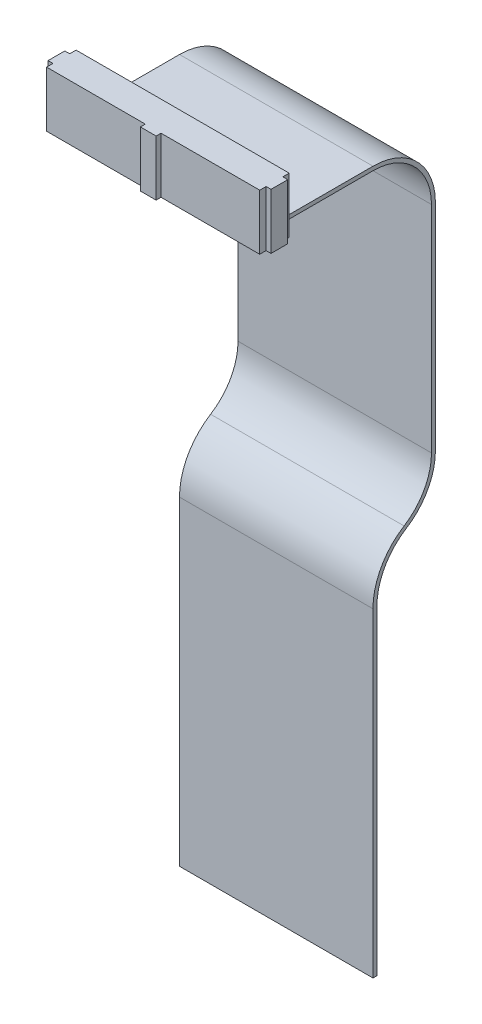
ISO-10303-21;
HEADER;
FILE_DESCRIPTION(('STEP AP214'),'2;1');
FILE_NAME('part.step','',(''),(''),'','','');
FILE_SCHEMA(('AUTOMOTIVE_DESIGN { 1 0 10303 214 1 1 1 1 }'));
ENDSEC;
DATA;
#1=APPLICATION_CONTEXT('core data for automotive mechanical design processes');
#2=APPLICATION_PROTOCOL_DEFINITION('international standard','automotive_design',2000,#1);
#3=PRODUCT_CONTEXT('',#1,'mechanical');
#4=PRODUCT('Part','Part','',(#3));
#5=PRODUCT_RELATED_PRODUCT_CATEGORY('part','',(#4));
#6=PRODUCT_DEFINITION_FORMATION('','',#4);
#7=PRODUCT_DEFINITION_CONTEXT('part definition',#1,'design');
#8=PRODUCT_DEFINITION('design','',#6,#7);
#9=PRODUCT_DEFINITION_SHAPE('','',#8);
#10=(LENGTH_UNIT() NAMED_UNIT(*) SI_UNIT(.MILLI.,.METRE.));
#11=(NAMED_UNIT(*) PLANE_ANGLE_UNIT() SI_UNIT($,.RADIAN.));
#12=(NAMED_UNIT(*) SI_UNIT($,.STERADIAN.) SOLID_ANGLE_UNIT());
#13=UNCERTAINTY_MEASURE_WITH_UNIT(LENGTH_MEASURE(1.E-05),#10,'distance_accuracy_value','');
#14=(GEOMETRIC_REPRESENTATION_CONTEXT(3) GLOBAL_UNCERTAINTY_ASSIGNED_CONTEXT((#13)) GLOBAL_UNIT_ASSIGNED_CONTEXT((#10,
#11,#12)) REPRESENTATION_CONTEXT('',''));
#15=CARTESIAN_POINT('',(0.,0.,0.));
#16=DIRECTION('',(0.,0.,1.));
#17=DIRECTION('',(1.,0.,0.));
#18=AXIS2_PLACEMENT_3D('',#15,#16,#17);
#19=CARTESIAN_POINT('',(-21.685,11.3,-6.00000000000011));
#20=DIRECTION('',(1.,0.,0.));
#21=DIRECTION('',(0.,0.,-1.00000000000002));
#22=AXIS2_PLACEMENT_3D('',#19,#20,#21);
#23=PLANE('',#22);
#24=DIRECTION('',(0.,0.,1.00000000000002));
#25=VECTOR('',#24,1.);
#26=CARTESIAN_POINT('',(-21.6850000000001,-2.22044604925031E-13,-6.00000000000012));
#27=LINE('',#26,#25);
#28=CARTESIAN_POINT('',(-21.6850000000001,-2.22044604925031E-13,-6.00000000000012));
#29=VERTEX_POINT('',#28);
#30=CARTESIAN_POINT('',(-21.6850000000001,-2.22044604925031E-13,-4.70000000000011));
#31=VERTEX_POINT('',#30);
#32=EDGE_CURVE('E356',#29,#31,#27,.T.);
#33=ORIENTED_EDGE('',*,*,#32,.T.);
#34=DIRECTION('',(0.,-1.,0.));
#35=VECTOR('',#34,1.);
#36=CARTESIAN_POINT('',(-21.685,11.3,-4.70000000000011));
#37=LINE('',#36,#35);
#38=CARTESIAN_POINT('',(-21.685,11.3,-4.70000000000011));
#39=VERTEX_POINT('',#38);
#40=EDGE_CURVE('E11',#39,#31,#37,.T.);
#41=ORIENTED_EDGE('',*,*,#40,.F.);
#42=DIRECTION('',(0.,0.,1.00000000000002));
#43=VECTOR('',#42,1.);
#44=CARTESIAN_POINT('',(-21.685,11.3,-6.00000000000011));
#45=LINE('',#44,#43);
#46=CARTESIAN_POINT('',(-21.685,11.3,-6.00000000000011));
#47=VERTEX_POINT('',#46);
#48=EDGE_CURVE('E389',#47,#39,#45,.T.);
#49=ORIENTED_EDGE('',*,*,#48,.F.);
#50=DIRECTION('',(0.,-1.,0.));
#51=VECTOR('',#50,1.);
#52=CARTESIAN_POINT('',(-21.685,11.3,-6.00000000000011));
#53=LINE('',#52,#51);
#54=EDGE_CURVE('E422',#47,#29,#53,.T.);
#55=ORIENTED_EDGE('',*,*,#54,.T.);
#56=EDGE_LOOP('',(#33,#41,#49,#55));
#57=FACE_BOUND('',#56,.T.);
#58=ADVANCED_FACE('F34',(#57),#23,.F.);
#59=CARTESIAN_POINT('',(-22.685,11.3,-4.70000000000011));
#60=DIRECTION('',(0.,0.,1.00000000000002));
#61=DIRECTION('',(1.,0.,0.));
#62=AXIS2_PLACEMENT_3D('',#59,#60,#61);
#63=PLANE('',#62);
#64=DIRECTION('',(-1.,0.,0.));
#65=VECTOR('',#64,1.);
#66=CARTESIAN_POINT('',(-22.6850000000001,-2.22044604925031E-13,-4.70000000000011));
#67=LINE('',#66,#65);
#68=CARTESIAN_POINT('',(-22.6850000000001,-2.22044604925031E-13,-4.70000000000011));
#69=VERTEX_POINT('',#68);
#70=EDGE_CURVE('E359',#31,#69,#67,.T.);
#71=ORIENTED_EDGE('',*,*,#70,.T.);
#72=DIRECTION('',(0.,-1.,0.));
#73=VECTOR('',#72,1.);
#74=CARTESIAN_POINT('',(-22.685,11.3,-4.70000000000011));
#75=LINE('',#74,#73);
#76=CARTESIAN_POINT('',(-22.685,11.3,-4.70000000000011));
#77=VERTEX_POINT('',#76);
#78=EDGE_CURVE('E41',#77,#69,#75,.T.);
#79=ORIENTED_EDGE('',*,*,#78,.F.);
#80=DIRECTION('',(-1.,0.,0.));
#81=VECTOR('',#80,1.);
#82=CARTESIAN_POINT('',(-22.685,11.3,-4.70000000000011));
#83=LINE('',#82,#81);
#84=EDGE_CURVE('E392',#39,#77,#83,.T.);
#85=ORIENTED_EDGE('',*,*,#84,.F.);
#86=ORIENTED_EDGE('',*,*,#40,.T.);
#87=EDGE_LOOP('',(#71,#79,#85,#86));
#88=FACE_BOUND('',#87,.T.);
#89=ADVANCED_FACE('F491',(#88),#63,.F.);
#90=CARTESIAN_POINT('',(-22.685,11.3,-4.70000000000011));
#91=DIRECTION('',(1.,0.,0.));
#92=DIRECTION('',(0.,0.,-1.00000000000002));
#93=AXIS2_PLACEMENT_3D('',#90,#91,#92);
#94=PLANE('',#93);
#95=DIRECTION('',(0.,0.,1.00000000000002));
#96=VECTOR('',#95,1.);
#97=CARTESIAN_POINT('',(-22.6850000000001,-2.22044604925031E-13,-4.70000000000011));
#98=LINE('',#97,#96);
#99=CARTESIAN_POINT('',(-22.6850000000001,-2.22044604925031E-13,-1.30000000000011));
#100=VERTEX_POINT('',#99);
#101=EDGE_CURVE('E361',#69,#100,#98,.T.);
#102=ORIENTED_EDGE('',*,*,#101,.T.);
#103=DIRECTION('',(0.,-1.,0.));
#104=VECTOR('',#103,1.);
#105=CARTESIAN_POINT('',(-22.685,11.3,-1.30000000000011));
#106=LINE('',#105,#104);
#107=CARTESIAN_POINT('',(-22.685,11.3,-1.30000000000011));
#108=VERTEX_POINT('',#107);
#109=EDGE_CURVE('E461',#108,#100,#106,.T.);
#110=ORIENTED_EDGE('',*,*,#109,.F.);
#111=DIRECTION('',(0.,0.,1.00000000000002));
#112=VECTOR('',#111,1.);
#113=CARTESIAN_POINT('',(-22.685,11.3,-4.70000000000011));
#114=LINE('',#113,#112);
#115=EDGE_CURVE('E394',#77,#108,#114,.T.);
#116=ORIENTED_EDGE('',*,*,#115,.F.);
#117=ORIENTED_EDGE('',*,*,#78,.T.);
#118=EDGE_LOOP('',(#102,#110,#116,#117));
#119=FACE_BOUND('',#118,.T.);
#120=ADVANCED_FACE('F468',(#119),#94,.F.);
#121=CARTESIAN_POINT('',(-22.685,11.3,-1.30000000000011));
#122=DIRECTION('',(0.,0.,-1.00000000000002));
#123=DIRECTION('',(-1.,0.,0.));
#124=AXIS2_PLACEMENT_3D('',#121,#122,#123);
#125=PLANE('',#124);
#126=DIRECTION('',(1.,0.,0.));
#127=VECTOR('',#126,1.);
#128=CARTESIAN_POINT('',(-22.6850000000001,-2.22044604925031E-13,-1.30000000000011));
#129=LINE('',#128,#127);
#130=CARTESIAN_POINT('',(-21.6850000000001,-2.22044604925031E-13,-1.30000000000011));
#131=VERTEX_POINT('',#130);
#132=EDGE_CURVE('E363',#100,#131,#129,.T.);
#133=ORIENTED_EDGE('',*,*,#132,.T.);
#134=DIRECTION('',(0.,-1.,0.));
#135=VECTOR('',#134,1.);
#136=CARTESIAN_POINT('',(-21.685,11.3,-1.30000000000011));
#137=LINE('',#136,#135);
#138=CARTESIAN_POINT('',(-21.685,11.3,-1.30000000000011));
#139=VERTEX_POINT('',#138);
#140=EDGE_CURVE('E458',#139,#131,#137,.T.);
#141=ORIENTED_EDGE('',*,*,#140,.F.);
#142=DIRECTION('',(1.,0.,0.));
#143=VECTOR('',#142,1.);
#144=CARTESIAN_POINT('',(-22.685,11.3,-1.30000000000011));
#145=LINE('',#144,#143);
#146=EDGE_CURVE('E396',#108,#139,#145,.T.);
#147=ORIENTED_EDGE('',*,*,#146,.F.);
#148=ORIENTED_EDGE('',*,*,#109,.T.);
#149=EDGE_LOOP('',(#133,#141,#147,#148));
#150=FACE_BOUND('',#149,.T.);
#151=ADVANCED_FACE('F479',(#150),#125,.F.);
#152=CARTESIAN_POINT('',(-21.685,11.3,-1.30000000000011));
#153=DIRECTION('',(1.,0.,0.));
#154=DIRECTION('',(0.,0.,-1.00000000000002));
#155=AXIS2_PLACEMENT_3D('',#152,#153,#154);
#156=PLANE('',#155);
#157=DIRECTION('',(0.,0.,1.00000000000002));
#158=VECTOR('',#157,1.);
#159=CARTESIAN_POINT('',(-21.6850000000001,-2.22044604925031E-13,-1.30000000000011));
#160=LINE('',#159,#158);
#161=CARTESIAN_POINT('',(-21.6850000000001,-2.22044604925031E-13,-1.11022302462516E-13));
#162=VERTEX_POINT('',#161);
#163=EDGE_CURVE('E365',#131,#162,#160,.T.);
#164=ORIENTED_EDGE('',*,*,#163,.T.);
#165=DIRECTION('',(0.,-1.,0.));
#166=VECTOR('',#165,1.);
#167=CARTESIAN_POINT('',(-21.685,11.3,-1.11022302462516E-13));
#168=LINE('',#167,#166);
#169=CARTESIAN_POINT('',(-21.685,11.3,-1.11022302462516E-13));
#170=VERTEX_POINT('',#169);
#171=EDGE_CURVE('E455',#170,#162,#168,.T.);
#172=ORIENTED_EDGE('',*,*,#171,.F.);
#173=DIRECTION('',(0.,0.,1.00000000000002));
#174=VECTOR('',#173,1.);
#175=CARTESIAN_POINT('',(-21.685,11.3,-1.30000000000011));
#176=LINE('',#175,#174);
#177=EDGE_CURVE('E398',#139,#170,#176,.T.);
#178=ORIENTED_EDGE('',*,*,#177,.F.);
#179=ORIENTED_EDGE('',*,*,#140,.T.);
#180=EDGE_LOOP('',(#164,#172,#178,#179));
#181=FACE_BOUND('',#180,.T.);
#182=ADVANCED_FACE('F483',(#181),#156,.F.);
#183=CARTESIAN_POINT('',(-21.685,11.3,-1.11022302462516E-13));
#184=DIRECTION('',(0.,0.,-1.00000000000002));
#185=DIRECTION('',(-1.,0.,0.));
#186=AXIS2_PLACEMENT_3D('',#183,#184,#185);
#187=PLANE('',#186);
#188=DIRECTION('',(1.,0.,0.));
#189=VECTOR('',#188,1.);
#190=CARTESIAN_POINT('',(-21.6850000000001,-2.22044604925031E-13,-1.11022302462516E-13));
#191=LINE('',#190,#189);
#192=CARTESIAN_POINT('',(-1.6,0.,0.));
#193=VERTEX_POINT('',#192);
#194=EDGE_CURVE('E367',#162,#193,#191,.T.);
#195=ORIENTED_EDGE('',*,*,#194,.T.);
#196=DIRECTION('',(0.,-1.,0.));
#197=VECTOR('',#196,1.);
#198=CARTESIAN_POINT('',(-1.59999999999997,11.3000000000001,0.));
#199=LINE('',#198,#197);
#200=CARTESIAN_POINT('',(-1.59999999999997,11.3000000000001,0.));
#201=VERTEX_POINT('',#200);
#202=EDGE_CURVE('E452',#201,#193,#199,.T.);
#203=ORIENTED_EDGE('',*,*,#202,.F.);
#204=DIRECTION('',(1.,0.,0.));
#205=VECTOR('',#204,1.);
#206=CARTESIAN_POINT('',(-21.685,11.3,-1.11022302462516E-13));
#207=LINE('',#206,#205);
#208=EDGE_CURVE('E400',#170,#201,#207,.T.);
#209=ORIENTED_EDGE('',*,*,#208,.F.);
#210=ORIENTED_EDGE('',*,*,#171,.T.);
#211=EDGE_LOOP('',(#195,#203,#209,#210));
#212=FACE_BOUND('',#211,.T.);
#213=ADVANCED_FACE('F544',(#212),#187,.F.);
#214=CARTESIAN_POINT('',(-1.59999999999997,11.3000000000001,0.));
#215=DIRECTION('',(1.,0.,0.));
#216=DIRECTION('',(0.,0.,-1.00000000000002));
#217=AXIS2_PLACEMENT_3D('',#214,#215,#216);
#218=PLANE('',#217);
#219=DIRECTION('',(0.,0.,1.00000000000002));
#220=VECTOR('',#219,1.);
#221=CARTESIAN_POINT('',(-1.6,0.,0.));
#222=LINE('',#221,#220);
#223=CARTESIAN_POINT('',(-1.59999999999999,0.,1.));
#224=VERTEX_POINT('',#223);
#225=EDGE_CURVE('E369',#193,#224,#222,.T.);
#226=ORIENTED_EDGE('',*,*,#225,.T.);
#227=DIRECTION('',(0.,-1.,0.));
#228=VECTOR('',#227,1.);
#229=CARTESIAN_POINT('',(-1.59999999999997,11.3000000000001,1.));
#230=LINE('',#229,#228);
#231=CARTESIAN_POINT('',(-1.59999999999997,11.3000000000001,1.));
#232=VERTEX_POINT('',#231);
#233=EDGE_CURVE('E449',#232,#224,#230,.T.);
#234=ORIENTED_EDGE('',*,*,#233,.F.);
#235=DIRECTION('',(0.,0.,1.00000000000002));
#236=VECTOR('',#235,1.);
#237=CARTESIAN_POINT('',(-1.59999999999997,11.3000000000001,0.));
#238=LINE('',#237,#236);
#239=EDGE_CURVE('E402',#201,#232,#238,.T.);
#240=ORIENTED_EDGE('',*,*,#239,.F.);
#241=ORIENTED_EDGE('',*,*,#202,.T.);
#242=EDGE_LOOP('',(#226,#234,#240,#241));
#243=FACE_BOUND('',#242,.T.);
#244=ADVANCED_FACE('F541',(#243),#218,.F.);
#245=CARTESIAN_POINT('',(-1.59999999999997,11.3000000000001,1.));
#246=DIRECTION('',(0.,0.,-1.00000000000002));
#247=DIRECTION('',(-1.,0.,0.));
#248=AXIS2_PLACEMENT_3D('',#245,#246,#247);
#249=PLANE('',#248);
#250=DIRECTION('',(1.,0.,0.));
#251=VECTOR('',#250,1.);
#252=CARTESIAN_POINT('',(-1.59999999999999,0.,1.));
#253=LINE('',#252,#251);
#254=CARTESIAN_POINT('',(1.60000000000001,0.,1.));
#255=VERTEX_POINT('',#254);
#256=EDGE_CURVE('E371',#224,#255,#253,.T.);
#257=ORIENTED_EDGE('',*,*,#256,.T.);
#258=DIRECTION('',(0.,-1.,0.));
#259=VECTOR('',#258,1.);
#260=CARTESIAN_POINT('',(1.60000000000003,11.3000000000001,1.));
#261=LINE('',#260,#259);
#262=CARTESIAN_POINT('',(1.60000000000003,11.3000000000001,1.));
#263=VERTEX_POINT('',#262);
#264=EDGE_CURVE('E446',#263,#255,#261,.T.);
#265=ORIENTED_EDGE('',*,*,#264,.F.);
#266=DIRECTION('',(1.,0.,0.));
#267=VECTOR('',#266,1.);
#268=CARTESIAN_POINT('',(-1.59999999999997,11.3000000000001,1.));
#269=LINE('',#268,#267);
#270=EDGE_CURVE('E404',#232,#263,#269,.T.);
#271=ORIENTED_EDGE('',*,*,#270,.F.);
#272=ORIENTED_EDGE('',*,*,#233,.T.);
#273=EDGE_LOOP('',(#257,#265,#271,#272));
#274=FACE_BOUND('',#273,.T.);
#275=ADVANCED_FACE('F537',(#274),#249,.F.);
#276=CARTESIAN_POINT('',(1.60000000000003,11.3000000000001,0.));
#277=DIRECTION('',(-1.,0.,0.));
#278=DIRECTION('',(0.,0.,1.00000000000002));
#279=AXIS2_PLACEMENT_3D('',#276,#277,#278);
#280=PLANE('',#279);
#281=DIRECTION('',(0.,0.,-1.00000000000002));
#282=VECTOR('',#281,1.);
#283=CARTESIAN_POINT('',(1.6,0.,0.));
#284=LINE('',#283,#282);
#285=CARTESIAN_POINT('',(1.6,0.,0.));
#286=VERTEX_POINT('',#285);
#287=EDGE_CURVE('E373',#255,#286,#284,.T.);
#288=ORIENTED_EDGE('',*,*,#287,.T.);
#289=DIRECTION('',(0.,-1.,0.));
#290=VECTOR('',#289,1.);
#291=CARTESIAN_POINT('',(1.60000000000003,11.3000000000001,0.));
#292=LINE('',#291,#290);
#293=CARTESIAN_POINT('',(1.60000000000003,11.3000000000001,0.));
#294=VERTEX_POINT('',#293);
#295=EDGE_CURVE('E443',#294,#286,#292,.T.);
#296=ORIENTED_EDGE('',*,*,#295,.F.);
#297=DIRECTION('',(0.,0.,-1.00000000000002));
#298=VECTOR('',#297,1.);
#299=CARTESIAN_POINT('',(1.60000000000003,11.3000000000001,0.));
#300=LINE('',#299,#298);
#301=EDGE_CURVE('E406',#263,#294,#300,.T.);
#302=ORIENTED_EDGE('',*,*,#301,.F.);
#303=ORIENTED_EDGE('',*,*,#264,.T.);
#304=EDGE_LOOP('',(#288,#296,#302,#303));
#305=FACE_BOUND('',#304,.T.);
#306=ADVANCED_FACE('F533',(#305),#280,.F.);
#307=CARTESIAN_POINT('',(1.60000000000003,11.3000000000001,0.));
#308=DIRECTION('',(0.,0.,-1.00000000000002));
#309=DIRECTION('',(-1.,0.,0.));
#310=AXIS2_PLACEMENT_3D('',#307,#308,#309);
#311=PLANE('',#310);
#312=DIRECTION('',(1.,0.,0.));
#313=VECTOR('',#312,1.);
#314=CARTESIAN_POINT('',(1.6,0.,0.));
#315=LINE('',#314,#313);
#316=CARTESIAN_POINT('',(21.6849999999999,2.22044604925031E-13,1.04083408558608E-13));
#317=VERTEX_POINT('',#316);
#318=EDGE_CURVE('E375',#286,#317,#315,.T.);
#319=ORIENTED_EDGE('',*,*,#318,.T.);
#320=DIRECTION('',(0.,-1.,0.));
#321=VECTOR('',#320,1.);
#322=CARTESIAN_POINT('',(21.685,11.3000000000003,1.11022302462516E-13));
#323=LINE('',#322,#321);
#324=CARTESIAN_POINT('',(21.685,11.3000000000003,1.11022302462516E-13));
#325=VERTEX_POINT('',#324);
#326=EDGE_CURVE('E440',#325,#317,#323,.T.);
#327=ORIENTED_EDGE('',*,*,#326,.F.);
#328=DIRECTION('',(1.,0.,0.));
#329=VECTOR('',#328,1.);
#330=CARTESIAN_POINT('',(1.60000000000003,11.3000000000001,0.));
#331=LINE('',#330,#329);
#332=EDGE_CURVE('E408',#294,#325,#331,.T.);
#333=ORIENTED_EDGE('',*,*,#332,.F.);
#334=ORIENTED_EDGE('',*,*,#295,.T.);
#335=EDGE_LOOP('',(#319,#327,#333,#334));
#336=FACE_BOUND('',#335,.T.);
#337=ADVANCED_FACE('F528',(#336),#311,.F.);
#338=CARTESIAN_POINT('',(21.685,11.3000000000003,-1.3));
#339=DIRECTION('',(-1.,0.,0.));
#340=DIRECTION('',(0.,0.,1.00000000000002));
#341=AXIS2_PLACEMENT_3D('',#338,#339,#340);
#342=PLANE('',#341);
#343=DIRECTION('',(0.,0.,-1.00000000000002));
#344=VECTOR('',#343,1.);
#345=CARTESIAN_POINT('',(21.6849999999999,2.22044604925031E-13,-1.29999999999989));
#346=LINE('',#345,#344);
#347=CARTESIAN_POINT('',(21.6849999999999,2.22044604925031E-13,-1.29999999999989));
#348=VERTEX_POINT('',#347);
#349=EDGE_CURVE('E377',#317,#348,#346,.T.);
#350=ORIENTED_EDGE('',*,*,#349,.T.);
#351=DIRECTION('',(0.,-1.,0.));
#352=VECTOR('',#351,1.);
#353=CARTESIAN_POINT('',(21.685,11.3000000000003,-1.3));
#354=LINE('',#353,#352);
#355=CARTESIAN_POINT('',(21.685,11.3000000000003,-1.3));
#356=VERTEX_POINT('',#355);
#357=EDGE_CURVE('E437',#356,#348,#354,.T.);
#358=ORIENTED_EDGE('',*,*,#357,.F.);
#359=DIRECTION('',(0.,0.,-1.00000000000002));
#360=VECTOR('',#359,1.);
#361=CARTESIAN_POINT('',(21.685,11.3000000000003,-1.3));
#362=LINE('',#361,#360);
#363=EDGE_CURVE('E410',#325,#356,#362,.T.);
#364=ORIENTED_EDGE('',*,*,#363,.F.);
#365=ORIENTED_EDGE('',*,*,#326,.T.);
#366=EDGE_LOOP('',(#350,#358,#364,#365));
#367=FACE_BOUND('',#366,.T.);
#368=ADVANCED_FACE('F522',(#367),#342,.F.);
#369=CARTESIAN_POINT('',(21.685,11.3000000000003,-1.3));
#370=DIRECTION('',(0.,0.,-1.00000000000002));
#371=DIRECTION('',(-1.,0.,0.));
#372=AXIS2_PLACEMENT_3D('',#369,#370,#371);
#373=PLANE('',#372);
#374=DIRECTION('',(1.,0.,0.));
#375=VECTOR('',#374,1.);
#376=CARTESIAN_POINT('',(21.6849999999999,2.22044604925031E-13,-1.29999999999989));
#377=LINE('',#376,#375);
#378=CARTESIAN_POINT('',(22.6849999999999,2.22044604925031E-13,-1.29999999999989));
#379=VERTEX_POINT('',#378);
#380=EDGE_CURVE('E379',#348,#379,#377,.T.);
#381=ORIENTED_EDGE('',*,*,#380,.T.);
#382=DIRECTION('',(0.,-1.,0.));
#383=VECTOR('',#382,1.);
#384=CARTESIAN_POINT('',(22.685,11.3000000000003,-1.29999999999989));
#385=LINE('',#384,#383);
#386=CARTESIAN_POINT('',(22.685,11.3000000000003,-1.29999999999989));
#387=VERTEX_POINT('',#386);
#388=EDGE_CURVE('E434',#387,#379,#385,.T.);
#389=ORIENTED_EDGE('',*,*,#388,.F.);
#390=DIRECTION('',(1.,0.,0.));
#391=VECTOR('',#390,1.);
#392=CARTESIAN_POINT('',(21.685,11.3000000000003,-1.3));
#393=LINE('',#392,#391);
#394=EDGE_CURVE('E412',#356,#387,#393,.T.);
#395=ORIENTED_EDGE('',*,*,#394,.F.);
#396=ORIENTED_EDGE('',*,*,#357,.T.);
#397=EDGE_LOOP('',(#381,#389,#395,#396));
#398=FACE_BOUND('',#397,.T.);
#399=ADVANCED_FACE('F518',(#398),#373,.F.);
#400=CARTESIAN_POINT('',(22.685,11.3000000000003,-4.7));
#401=DIRECTION('',(-1.,0.,0.));
#402=DIRECTION('',(0.,0.,1.00000000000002));
#403=AXIS2_PLACEMENT_3D('',#400,#401,#402);
#404=PLANE('',#403);
#405=DIRECTION('',(0.,0.,-1.00000000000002));
#406=VECTOR('',#405,1.);
#407=CARTESIAN_POINT('',(22.6849999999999,2.22044604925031E-13,-4.7));
#408=LINE('',#407,#406);
#409=CARTESIAN_POINT('',(22.6849999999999,2.22044604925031E-13,-4.7));
#410=VERTEX_POINT('',#409);
#411=EDGE_CURVE('E381',#379,#410,#408,.T.);
#412=ORIENTED_EDGE('',*,*,#411,.T.);
#413=DIRECTION('',(0.,-1.,0.));
#414=VECTOR('',#413,1.);
#415=CARTESIAN_POINT('',(22.685,11.3000000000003,-4.7));
#416=LINE('',#415,#414);
#417=CARTESIAN_POINT('',(22.685,11.3000000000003,-4.7));
#418=VERTEX_POINT('',#417);
#419=EDGE_CURVE('E431',#418,#410,#416,.T.);
#420=ORIENTED_EDGE('',*,*,#419,.F.);
#421=DIRECTION('',(0.,0.,-1.00000000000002));
#422=VECTOR('',#421,1.);
#423=CARTESIAN_POINT('',(22.685,11.3000000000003,-4.7));
#424=LINE('',#423,#422);
#425=EDGE_CURVE('E414',#387,#418,#424,.T.);
#426=ORIENTED_EDGE('',*,*,#425,.F.);
#427=ORIENTED_EDGE('',*,*,#388,.T.);
#428=EDGE_LOOP('',(#412,#420,#426,#427));
#429=FACE_BOUND('',#428,.T.);
#430=ADVANCED_FACE('F513',(#429),#404,.F.);
#431=CARTESIAN_POINT('',(21.685,11.3000000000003,-4.7));
#432=DIRECTION('',(0.,0.,1.00000000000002));
#433=DIRECTION('',(1.,0.,0.));
#434=AXIS2_PLACEMENT_3D('',#431,#432,#433);
#435=PLANE('',#434);
#436=DIRECTION('',(-1.,0.,0.));
#437=VECTOR('',#436,1.);
#438=CARTESIAN_POINT('',(21.6849999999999,2.22044604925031E-13,-4.7));
#439=LINE('',#438,#437);
#440=CARTESIAN_POINT('',(21.6849999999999,2.22044604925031E-13,-4.7));
#441=VERTEX_POINT('',#440);
#442=EDGE_CURVE('E383',#410,#441,#439,.T.);
#443=ORIENTED_EDGE('',*,*,#442,.T.);
#444=DIRECTION('',(0.,-1.,0.));
#445=VECTOR('',#444,1.);
#446=CARTESIAN_POINT('',(21.685,11.3000000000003,-4.7));
#447=LINE('',#446,#445);
#448=CARTESIAN_POINT('',(21.685,11.3000000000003,-4.7));
#449=VERTEX_POINT('',#448);
#450=EDGE_CURVE('E428',#449,#441,#447,.T.);
#451=ORIENTED_EDGE('',*,*,#450,.F.);
#452=DIRECTION('',(-1.,0.,0.));
#453=VECTOR('',#452,1.);
#454=CARTESIAN_POINT('',(21.685,11.3000000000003,-4.7));
#455=LINE('',#454,#453);
#456=EDGE_CURVE('E416',#418,#449,#455,.T.);
#457=ORIENTED_EDGE('',*,*,#456,.F.);
#458=ORIENTED_EDGE('',*,*,#419,.T.);
#459=EDGE_LOOP('',(#443,#451,#457,#458));
#460=FACE_BOUND('',#459,.T.);
#461=ADVANCED_FACE('F507',(#460),#435,.F.);
#462=CARTESIAN_POINT('',(21.685,11.3000000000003,-6.00000000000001));
#463=DIRECTION('',(-1.,0.,0.));
#464=DIRECTION('',(0.,0.,1.00000000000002));
#465=AXIS2_PLACEMENT_3D('',#462,#463,#464);
#466=PLANE('',#465);
#467=DIRECTION('',(0.,0.,-1.00000000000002));
#468=VECTOR('',#467,1.);
#469=CARTESIAN_POINT('',(21.6849999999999,0.,-6.00000000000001));
#470=LINE('',#469,#468);
#471=CARTESIAN_POINT('',(21.6849999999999,0.,-6.00000000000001));
#472=VERTEX_POINT('',#471);
#473=EDGE_CURVE('E385',#441,#472,#470,.T.);
#474=ORIENTED_EDGE('',*,*,#473,.T.);
#475=DIRECTION('',(0.,-1.,0.));
#476=VECTOR('',#475,1.);
#477=CARTESIAN_POINT('',(21.685,11.3000000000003,-6.00000000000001));
#478=LINE('',#477,#476);
#479=CARTESIAN_POINT('',(21.685,11.3000000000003,-6.00000000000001));
#480=VERTEX_POINT('',#479);
#481=EDGE_CURVE('E425',#480,#472,#478,.T.);
#482=ORIENTED_EDGE('',*,*,#481,.F.);
#483=DIRECTION('',(0.,0.,-1.00000000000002));
#484=VECTOR('',#483,1.);
#485=CARTESIAN_POINT('',(21.685,11.3000000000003,-6.00000000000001));
#486=LINE('',#485,#484);
#487=EDGE_CURVE('E418',#449,#480,#486,.T.);
#488=ORIENTED_EDGE('',*,*,#487,.F.);
#489=ORIENTED_EDGE('',*,*,#450,.T.);
#490=EDGE_LOOP('',(#474,#482,#488,#489));
#491=FACE_BOUND('',#490,.T.);
#492=ADVANCED_FACE('F503',(#491),#466,.F.);
#493=CARTESIAN_POINT('',(-21.685,11.3,-6.00000000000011));
#494=DIRECTION('',(0.,0.,1.00000000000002));
#495=DIRECTION('',(1.,0.,0.));
#496=AXIS2_PLACEMENT_3D('',#493,#494,#495);
#497=PLANE('',#496);
#498=DIRECTION('',(-1.,0.,0.));
#499=VECTOR('',#498,1.);
#500=CARTESIAN_POINT('',(19.6849999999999,1.20000000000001,-6.00000000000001));
#501=LINE('',#500,#499);
#502=CARTESIAN_POINT('',(19.6849999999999,1.20000000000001,-6.00000000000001));
#503=VERTEX_POINT('',#502);
#504=CARTESIAN_POINT('',(-19.6850000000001,1.19999999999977,-6.00000000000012));
#505=VERTEX_POINT('',#504);
#506=EDGE_CURVE('E48',#503,#505,#501,.T.);
#507=ORIENTED_EDGE('',*,*,#506,.F.);
#508=DIRECTION('',(0.,-1.,0.));
#509=VECTOR('',#508,1.);
#510=CARTESIAN_POINT('',(19.6849999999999,2.,-6.00000000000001));
#511=LINE('',#510,#509);
#512=CARTESIAN_POINT('',(19.6849999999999,2.,-6.00000000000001));
#513=VERTEX_POINT('',#512);
#514=EDGE_CURVE('E53',#513,#503,#511,.T.);
#515=ORIENTED_EDGE('',*,*,#514,.F.);
#516=DIRECTION('',(-1.,0.,0.));
#517=VECTOR('',#516,1.);
#518=CARTESIAN_POINT('',(19.6849999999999,2.,-6.00000000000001));
#519=LINE('',#518,#517);
#520=CARTESIAN_POINT('',(-19.6850000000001,1.99999999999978,-6.00000000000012));
#521=VERTEX_POINT('',#520);
#522=EDGE_CURVE('E353',#513,#521,#519,.T.);
#523=ORIENTED_EDGE('',*,*,#522,.T.);
#524=DIRECTION('',(0.,-1.,0.));
#525=VECTOR('',#524,1.);
#526=CARTESIAN_POINT('',(-19.6850000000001,1.99999999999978,-6.00000000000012));
#527=LINE('',#526,#525);
#528=EDGE_CURVE('E237',#521,#505,#527,.T.);
#529=ORIENTED_EDGE('',*,*,#528,.T.);
#530=EDGE_LOOP('',(#507,#515,#523,#529));
#531=FACE_BOUND('',#530,.T.);
#532=DIRECTION('',(-1.,0.,0.));
#533=VECTOR('',#532,1.);
#534=CARTESIAN_POINT('',(-21.6850000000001,-2.22044604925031E-13,-6.00000000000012));
#535=LINE('',#534,#533);
#536=EDGE_CURVE('E387',#472,#29,#535,.T.);
#537=ORIENTED_EDGE('',*,*,#536,.T.);
#538=ORIENTED_EDGE('',*,*,#54,.F.);
#539=DIRECTION('',(-1.,0.,0.));
#540=VECTOR('',#539,1.);
#541=CARTESIAN_POINT('',(-21.685,11.3,-6.00000000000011));
#542=LINE('',#541,#540);
#543=EDGE_CURVE('E420',#480,#47,#542,.T.);
#544=ORIENTED_EDGE('',*,*,#543,.F.);
#545=ORIENTED_EDGE('',*,*,#481,.T.);
#546=EDGE_LOOP('',(#537,#538,#544,#545));
#547=FACE_BOUND('',#546,.T.);
#548=ADVANCED_FACE('F498',(#531,#547),#497,.F.);
#549=CARTESIAN_POINT('',(-21.685,11.3,-4.70000000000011));
#550=DIRECTION('',(0.,1.,0.));
#551=DIRECTION('',(0.,0.,1.00000000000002));
#552=AXIS2_PLACEMENT_3D('',#549,#550,#551);
#553=PLANE('',#552);
#554=ORIENTED_EDGE('',*,*,#48,.T.);
#555=ORIENTED_EDGE('',*,*,#84,.T.);
#556=ORIENTED_EDGE('',*,*,#115,.T.);
#557=ORIENTED_EDGE('',*,*,#146,.T.);
#558=ORIENTED_EDGE('',*,*,#177,.T.);
#559=ORIENTED_EDGE('',*,*,#208,.T.);
#560=ORIENTED_EDGE('',*,*,#239,.T.);
#561=ORIENTED_EDGE('',*,*,#270,.T.);
#562=ORIENTED_EDGE('',*,*,#301,.T.);
#563=ORIENTED_EDGE('',*,*,#332,.T.);
#564=ORIENTED_EDGE('',*,*,#363,.T.);
#565=ORIENTED_EDGE('',*,*,#394,.T.);
#566=ORIENTED_EDGE('',*,*,#425,.T.);
#567=ORIENTED_EDGE('',*,*,#456,.T.);
#568=ORIENTED_EDGE('',*,*,#487,.T.);
#569=ORIENTED_EDGE('',*,*,#543,.T.);
#570=EDGE_LOOP('',(#554,#555,#556,#557,#558,#559,#560,#561,#562,#563,#564,#565,#566,#567,#568,#569));
#571=FACE_BOUND('',#570,.T.);
#572=ADVANCED_FACE('F487',(#571),#553,.T.);
#573=CARTESIAN_POINT('',(-21.6850000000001,-2.22044604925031E-13,-4.70000000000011));
#574=DIRECTION('',(0.,1.,0.));
#575=DIRECTION('',(0.,0.,1.00000000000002));
#576=AXIS2_PLACEMENT_3D('',#573,#574,#575);
#577=PLANE('',#576);
#578=ORIENTED_EDGE('',*,*,#32,.F.);
#579=ORIENTED_EDGE('',*,*,#536,.F.);
#580=ORIENTED_EDGE('',*,*,#473,.F.);
#581=ORIENTED_EDGE('',*,*,#442,.F.);
#582=ORIENTED_EDGE('',*,*,#411,.F.);
#583=ORIENTED_EDGE('',*,*,#380,.F.);
#584=ORIENTED_EDGE('',*,*,#349,.F.);
#585=ORIENTED_EDGE('',*,*,#318,.F.);
#586=ORIENTED_EDGE('',*,*,#287,.F.);
#587=ORIENTED_EDGE('',*,*,#256,.F.);
#588=ORIENTED_EDGE('',*,*,#225,.F.);
#589=ORIENTED_EDGE('',*,*,#194,.F.);
#590=ORIENTED_EDGE('',*,*,#163,.F.);
#591=ORIENTED_EDGE('',*,*,#132,.F.);
#592=ORIENTED_EDGE('',*,*,#101,.F.);
#593=ORIENTED_EDGE('',*,*,#70,.F.);
#594=EDGE_LOOP('',(#578,#579,#580,#581,#582,#583,#584,#585,#586,#587,#588,#589,#590,#591,#592,#593));
#595=FACE_BOUND('',#594,.T.);
#596=ADVANCED_FACE('F474',(#595),#577,.F.);
#597=CARTESIAN_POINT('',(19.6849999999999,1.20000000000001,-6.00000000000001));
#598=DIRECTION('',(0.,1.,0.));
#599=DIRECTION('',(0.,0.,1.00000000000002));
#600=AXIS2_PLACEMENT_3D('',#597,#598,#599);
#601=PLANE('',#600);
#602=DIRECTION('',(0.,0.,-1.00000000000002));
#603=VECTOR('',#602,1.);
#604=CARTESIAN_POINT('',(-19.6850000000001,1.19999999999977,-6.00000000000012));
#605=LINE('',#604,#603);
#606=CARTESIAN_POINT('',(-19.6850000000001,1.19999999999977,-25.0500000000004));
#607=VERTEX_POINT('',#606);
#608=EDGE_CURVE('E229',#505,#607,#605,.T.);
#609=ORIENTED_EDGE('',*,*,#608,.T.);
#610=DIRECTION('',(-1.,0.,0.));
#611=VECTOR('',#610,1.);
#612=CARTESIAN_POINT('',(19.6849999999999,1.20000000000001,-25.0500000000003));
#613=LINE('',#612,#611);
#614=CARTESIAN_POINT('',(19.6849999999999,1.20000000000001,-25.0500000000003));
#615=VERTEX_POINT('',#614);
#616=EDGE_CURVE('E233',#615,#607,#613,.T.);
#617=ORIENTED_EDGE('',*,*,#616,.F.);
#618=DIRECTION('',(0.,0.,-1.00000000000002));
#619=VECTOR('',#618,1.);
#620=CARTESIAN_POINT('',(19.6849999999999,1.20000000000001,-6.00000000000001));
#621=LINE('',#620,#619);
#622=EDGE_CURVE('E349',#503,#615,#621,.T.);
#623=ORIENTED_EDGE('',*,*,#622,.F.);
#624=ORIENTED_EDGE('',*,*,#506,.T.);
#625=EDGE_LOOP('',(#609,#617,#623,#624));
#626=FACE_BOUND('',#625,.T.);
#627=ADVANCED_FACE('F231',(#626),#601,.F.);
#628=CARTESIAN_POINT('',(19.6849999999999,2.,-6.00000000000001));
#629=DIRECTION('',(0.,-1.,0.));
#630=DIRECTION('',(0.,0.,-1.00000000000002));
#631=AXIS2_PLACEMENT_3D('',#628,#629,#630);
#632=PLANE('',#631);
#633=DIRECTION('',(0.,0.,1.00000000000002));
#634=VECTOR('',#633,1.);
#635=CARTESIAN_POINT('',(-19.6850000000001,1.99999999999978,-6.00000000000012));
#636=LINE('',#635,#634);
#637=CARTESIAN_POINT('',(-19.6850000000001,1.99999999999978,-25.0500000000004));
#638=VERTEX_POINT('',#637);
#639=EDGE_CURVE('E236',#638,#521,#636,.T.);
#640=ORIENTED_EDGE('',*,*,#639,.T.);
#641=ORIENTED_EDGE('',*,*,#522,.F.);
#642=DIRECTION('',(0.,0.,1.00000000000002));
#643=VECTOR('',#642,1.);
#644=CARTESIAN_POINT('',(19.6849999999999,2.,-6.00000000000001));
#645=LINE('',#644,#643);
#646=CARTESIAN_POINT('',(19.6849999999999,2.,-25.0500000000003));
#647=VERTEX_POINT('',#646);
#648=EDGE_CURVE('E351',#647,#513,#645,.T.);
#649=ORIENTED_EDGE('',*,*,#648,.F.);
#650=DIRECTION('',(1.,0.,0.));
#651=VECTOR('',#650,1.);
#652=CARTESIAN_POINT('',(-19.6850000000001,1.99999999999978,-25.0500000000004));
#653=LINE('',#652,#651);
#654=EDGE_CURVE('E254',#638,#647,#653,.T.);
#655=ORIENTED_EDGE('',*,*,#654,.F.);
#656=EDGE_LOOP('',(#640,#641,#649,#655));
#657=FACE_BOUND('',#656,.T.);
#658=ADVANCED_FACE('F651',(#657),#632,.F.);
#659=CARTESIAN_POINT('',(19.6849999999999,1.20000000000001,-6.00000000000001));
#660=DIRECTION('',(1.,0.,0.));
#661=DIRECTION('',(0.,0.,-1.00000000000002));
#662=AXIS2_PLACEMENT_3D('',#659,#660,#661);
#663=PLANE('',#662);
#664=ORIENTED_EDGE('',*,*,#514,.T.);
#665=ORIENTED_EDGE('',*,*,#622,.T.);
#666=CARTESIAN_POINT('',(19.6849999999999,-10.7,-25.0500000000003));
#667=DIRECTION('',(-1.,0.,0.));
#668=DIRECTION('',(0.,0.,1.00000000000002));
#669=AXIS2_PLACEMENT_3D('',#666,#667,#668);
#670=CIRCLE('',#669,11.9);
#671=CARTESIAN_POINT('',(19.6849999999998,-10.7,-36.9500000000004));
#672=VERTEX_POINT('',#671);
#673=EDGE_CURVE('E253',#615,#672,#670,.T.);
#674=ORIENTED_EDGE('',*,*,#673,.T.);
#675=DIRECTION('',(0.,-1.,0.));
#676=VECTOR('',#675,1.);
#677=CARTESIAN_POINT('',(19.6849999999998,-10.7,-36.9500000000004));
#678=LINE('',#677,#676);
#679=CARTESIAN_POINT('',(19.6849999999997,-54.480736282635,-36.9500000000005));
#680=VERTEX_POINT('',#679);
#681=EDGE_CURVE('E275',#672,#680,#678,.T.);
#682=ORIENTED_EDGE('',*,*,#681,.T.);
#683=CARTESIAN_POINT('',(19.6849999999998,-54.480736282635,-25.0500000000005));
#684=DIRECTION('',(-1.,0.,0.));
#685=DIRECTION('',(0.,0.,1.00000000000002));
#686=AXIS2_PLACEMENT_3D('',#683,#684,#685);
#687=CIRCLE('',#686,11.9);
#688=CARTESIAN_POINT('',(19.6849999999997,-64.5625960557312,-31.3718750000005));
#689=VERTEX_POINT('',#688);
#690=EDGE_CURVE('E291',#680,#689,#687,.T.);
#691=ORIENTED_EDGE('',*,*,#690,.T.);
#692=CARTESIAN_POINT('',(19.6849999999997,-76.,-38.5437500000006));
#693=DIRECTION('',(1.,0.,0.));
#694=DIRECTION('',(0.,0.,-1.00000000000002));
#695=AXIS2_PLACEMENT_3D('',#692,#693,#694);
#696=CIRCLE('',#695,13.5);
#697=CARTESIAN_POINT('',(19.6849999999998,-76.,-25.0437500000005));
#698=VERTEX_POINT('',#697);
#699=EDGE_CURVE('E309',#689,#698,#696,.T.);
#700=ORIENTED_EDGE('',*,*,#699,.T.);
#701=DIRECTION('',(0.,-1.,0.));
#702=VECTOR('',#701,1.);
#703=CARTESIAN_POINT('',(19.6849999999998,-76.,-25.0437500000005));
#704=LINE('',#703,#702);
#705=CARTESIAN_POINT('',(19.6849999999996,-141.06554062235,-25.0437500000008));
#706=VERTEX_POINT('',#705);
#707=EDGE_CURVE('E333',#698,#706,#704,.T.);
#708=ORIENTED_EDGE('',*,*,#707,.T.);
#709=DIRECTION('',(0.,0.,1.00000000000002));
#710=VECTOR('',#709,1.);
#711=CARTESIAN_POINT('',(19.6849999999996,-141.06554062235,-25.8437500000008));
#712=LINE('',#711,#710);
#713=CARTESIAN_POINT('',(19.6849999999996,-141.06554062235,-25.8437500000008));
#714=VERTEX_POINT('',#713);
#715=EDGE_CURVE('E324',#714,#706,#712,.T.);
#716=ORIENTED_EDGE('',*,*,#715,.F.);
#717=DIRECTION('',(0.,-1.,0.));
#718=VECTOR('',#717,1.);
#719=CARTESIAN_POINT('',(19.6849999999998,-76.,-25.8437500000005));
#720=LINE('',#719,#718);
#721=CARTESIAN_POINT('',(19.6849999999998,-76.,-25.8437500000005));
#722=VERTEX_POINT('',#721);
#723=EDGE_CURVE('E336',#722,#714,#720,.T.);
#724=ORIENTED_EDGE('',*,*,#723,.F.);
#725=CARTESIAN_POINT('',(19.6849999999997,-76.,-38.5437500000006));
#726=DIRECTION('',(1.,0.,0.));
#727=DIRECTION('',(0.,0.,-1.00000000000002));
#728=AXIS2_PLACEMENT_3D('',#725,#726,#727);
#729=CIRCLE('',#728,12.7);
#730=CARTESIAN_POINT('',(19.6849999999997,-65.2403681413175,-31.7968750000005));
#731=VERTEX_POINT('',#730);
#732=EDGE_CURVE('E312',#731,#722,#729,.T.);
#733=ORIENTED_EDGE('',*,*,#732,.F.);
#734=CARTESIAN_POINT('',(19.6849999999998,-54.480736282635,-25.0500000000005));
#735=DIRECTION('',(-1.,0.,0.));
#736=DIRECTION('',(0.,0.,1.00000000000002));
#737=AXIS2_PLACEMENT_3D('',#734,#735,#736);
#738=CIRCLE('',#737,12.7);
#739=CARTESIAN_POINT('',(19.6849999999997,-54.480736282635,-37.7500000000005));
#740=VERTEX_POINT('',#739);
#741=EDGE_CURVE('E294',#740,#731,#738,.T.);
#742=ORIENTED_EDGE('',*,*,#741,.F.);
#743=DIRECTION('',(0.,-1.,0.));
#744=VECTOR('',#743,1.);
#745=CARTESIAN_POINT('',(19.6849999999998,-10.7,-37.7500000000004));
#746=LINE('',#745,#744);
#747=CARTESIAN_POINT('',(19.6849999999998,-10.7,-37.7500000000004));
#748=VERTEX_POINT('',#747);
#749=EDGE_CURVE('E278',#748,#740,#746,.T.);
#750=ORIENTED_EDGE('',*,*,#749,.F.);
#751=CARTESIAN_POINT('',(19.6849999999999,-10.7,-25.0500000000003));
#752=DIRECTION('',(-1.,0.,0.));
#753=DIRECTION('',(0.,0.,1.00000000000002));
#754=AXIS2_PLACEMENT_3D('',#751,#752,#753);
#755=CIRCLE('',#754,12.7);
#756=EDGE_CURVE('E265',#647,#748,#755,.T.);
#757=ORIENTED_EDGE('',*,*,#756,.F.);
#758=ORIENTED_EDGE('',*,*,#648,.T.);
#759=EDGE_LOOP('',(#664,#665,#674,#682,#691,#700,#708,#716,#724,#733,#742,#750,#757,#758));
#760=FACE_BOUND('',#759,.T.);
#761=ADVANCED_FACE('F661',(#760),#663,.T.);
#762=CARTESIAN_POINT('',(-19.6850000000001,1.19999999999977,-6.00000000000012));
#763=DIRECTION('',(1.,0.,0.));
#764=DIRECTION('',(0.,0.,-1.00000000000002));
#765=AXIS2_PLACEMENT_3D('',#762,#763,#764);
#766=PLANE('',#765);
#767=ORIENTED_EDGE('',*,*,#528,.F.);
#768=ORIENTED_EDGE('',*,*,#639,.F.);
#769=CARTESIAN_POINT('',(-19.6850000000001,-10.7000000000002,-25.0500000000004));
#770=DIRECTION('',(-1.,0.,0.));
#771=DIRECTION('',(0.,0.,1.00000000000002));
#772=AXIS2_PLACEMENT_3D('',#769,#770,#771);
#773=CIRCLE('',#772,12.7);
#774=CARTESIAN_POINT('',(-19.6850000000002,-10.7000000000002,-37.7500000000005));
#775=VERTEX_POINT('',#774);
#776=EDGE_CURVE('E248',#638,#775,#773,.T.);
#777=ORIENTED_EDGE('',*,*,#776,.T.);
#778=DIRECTION('',(0.,-1.,0.));
#779=VECTOR('',#778,1.);
#780=CARTESIAN_POINT('',(-19.6850000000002,-10.7000000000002,-37.7500000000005));
#781=LINE('',#780,#779);
#782=CARTESIAN_POINT('',(-19.6850000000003,-54.480736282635,-37.7500000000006));
#783=VERTEX_POINT('',#782);
#784=EDGE_CURVE('E281',#775,#783,#781,.T.);
#785=ORIENTED_EDGE('',*,*,#784,.T.);
#786=CARTESIAN_POINT('',(-19.6850000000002,-54.480736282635,-25.0500000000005));
#787=DIRECTION('',(-1.,0.,0.));
#788=DIRECTION('',(0.,0.,1.00000000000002));
#789=AXIS2_PLACEMENT_3D('',#786,#787,#788);
#790=CIRCLE('',#789,12.7);
#791=CARTESIAN_POINT('',(-19.6850000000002,-65.2403681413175,-31.7968750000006));
#792=VERTEX_POINT('',#791);
#793=EDGE_CURVE('E297',#783,#792,#790,.T.);
#794=ORIENTED_EDGE('',*,*,#793,.T.);
#795=CARTESIAN_POINT('',(-19.6850000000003,-76.,-38.5437500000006));
#796=DIRECTION('',(1.,0.,0.));
#797=DIRECTION('',(0.,0.,-1.00000000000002));
#798=AXIS2_PLACEMENT_3D('',#795,#796,#797);
#799=CIRCLE('',#798,12.7);
#800=CARTESIAN_POINT('',(-19.6850000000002,-76.,-25.8437500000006));
#801=VERTEX_POINT('',#800);
#802=EDGE_CURVE('E315',#792,#801,#799,.T.);
#803=ORIENTED_EDGE('',*,*,#802,.T.);
#804=DIRECTION('',(0.,-1.,0.));
#805=VECTOR('',#804,1.);
#806=CARTESIAN_POINT('',(-19.6850000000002,-76.,-25.8437500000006));
#807=LINE('',#806,#805);
#808=CARTESIAN_POINT('',(-19.6850000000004,-141.06554062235,-25.8437500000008));
#809=VERTEX_POINT('',#808);
#810=EDGE_CURVE('E339',#801,#809,#807,.T.);
#811=ORIENTED_EDGE('',*,*,#810,.T.);
#812=DIRECTION('',(0.,0.,-1.00000000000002));
#813=VECTOR('',#812,1.);
#814=CARTESIAN_POINT('',(-19.6850000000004,-141.06554062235,-25.0437500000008));
#815=LINE('',#814,#813);
#816=CARTESIAN_POINT('',(-19.6850000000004,-141.06554062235,-25.0437500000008));
#817=VERTEX_POINT('',#816);
#818=EDGE_CURVE('E330',#817,#809,#815,.T.);
#819=ORIENTED_EDGE('',*,*,#818,.F.);
#820=DIRECTION('',(0.,-1.,0.));
#821=VECTOR('',#820,1.);
#822=CARTESIAN_POINT('',(-19.6850000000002,-76.,-25.0437500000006));
#823=LINE('',#822,#821);
#824=CARTESIAN_POINT('',(-19.6850000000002,-76.,-25.0437500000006));
#825=VERTEX_POINT('',#824);
#826=EDGE_CURVE('E342',#825,#817,#823,.T.);
#827=ORIENTED_EDGE('',*,*,#826,.F.);
#828=CARTESIAN_POINT('',(-19.6850000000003,-76.,-38.5437500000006));
#829=DIRECTION('',(1.,0.,0.));
#830=DIRECTION('',(0.,0.,-1.00000000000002));
#831=AXIS2_PLACEMENT_3D('',#828,#829,#830);
#832=CIRCLE('',#831,13.5);
#833=CARTESIAN_POINT('',(-19.6850000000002,-64.5625960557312,-31.3718750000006));
#834=VERTEX_POINT('',#833);
#835=EDGE_CURVE('E318',#834,#825,#832,.T.);
#836=ORIENTED_EDGE('',*,*,#835,.F.);
#837=CARTESIAN_POINT('',(-19.6850000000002,-54.480736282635,-25.0500000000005));
#838=DIRECTION('',(-1.,0.,0.));
#839=DIRECTION('',(0.,0.,1.00000000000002));
#840=AXIS2_PLACEMENT_3D('',#837,#838,#839);
#841=CIRCLE('',#840,11.9);
#842=CARTESIAN_POINT('',(-19.6850000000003,-54.480736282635,-36.9500000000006));
#843=VERTEX_POINT('',#842);
#844=EDGE_CURVE('E300',#843,#834,#841,.T.);
#845=ORIENTED_EDGE('',*,*,#844,.F.);
#846=DIRECTION('',(0.,-1.,0.));
#847=VECTOR('',#846,1.);
#848=CARTESIAN_POINT('',(-19.6850000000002,-10.7000000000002,-36.9500000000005));
#849=LINE('',#848,#847);
#850=CARTESIAN_POINT('',(-19.6850000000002,-10.7000000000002,-36.9500000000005));
#851=VERTEX_POINT('',#850);
#852=EDGE_CURVE('E243',#851,#843,#849,.T.);
#853=ORIENTED_EDGE('',*,*,#852,.F.);
#854=CARTESIAN_POINT('',(-19.6850000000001,-10.7000000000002,-25.0500000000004));
#855=DIRECTION('',(-1.,0.,0.));
#856=DIRECTION('',(0.,0.,1.00000000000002));
#857=AXIS2_PLACEMENT_3D('',#854,#855,#856);
#858=CIRCLE('',#857,11.9);
#859=EDGE_CURVE('E240',#607,#851,#858,.T.);
#860=ORIENTED_EDGE('',*,*,#859,.F.);
#861=ORIENTED_EDGE('',*,*,#608,.F.);
#862=EDGE_LOOP('',(#767,#768,#777,#785,#794,#803,#811,#819,#827,#836,#845,#853,#860,#861));
#863=FACE_BOUND('',#862,.T.);
#864=ADVANCED_FACE('F241',(#863),#766,.F.);
#865=CARTESIAN_POINT('',(-19.6850000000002,-76.,-25.8437500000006));
#866=DIRECTION('',(0.,0.,-1.00000000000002));
#867=DIRECTION('',(0.,1.,0.));
#868=AXIS2_PLACEMENT_3D('',#865,#866,#867);
#869=PLANE('',#868);
#870=DIRECTION('',(1.,0.,0.));
#871=VECTOR('',#870,1.);
#872=CARTESIAN_POINT('',(-19.6850000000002,-76.,-25.8437500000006));
#873=LINE('',#872,#871);
#874=EDGE_CURVE('E306',#801,#722,#873,.T.);
#875=ORIENTED_EDGE('',*,*,#874,.T.);
#876=ORIENTED_EDGE('',*,*,#723,.T.);
#877=DIRECTION('',(1.,0.,0.));
#878=VECTOR('',#877,1.);
#879=CARTESIAN_POINT('',(-19.6850000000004,-141.06554062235,-25.8437500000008));
#880=LINE('',#879,#878);
#881=EDGE_CURVE('E327',#809,#714,#880,.T.);
#882=ORIENTED_EDGE('',*,*,#881,.F.);
#883=ORIENTED_EDGE('',*,*,#810,.F.);
#884=EDGE_LOOP('',(#875,#876,#882,#883));
#885=FACE_BOUND('',#884,.T.);
#886=ADVANCED_FACE('F679',(#885),#869,.T.);
#887=CARTESIAN_POINT('',(19.6849999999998,-76.,-25.0437500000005));
#888=DIRECTION('',(0.,0.,1.00000000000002));
#889=DIRECTION('',(0.,-1.,0.));
#890=AXIS2_PLACEMENT_3D('',#887,#888,#889);
#891=PLANE('',#890);
#892=DIRECTION('',(-1.,0.,0.));
#893=VECTOR('',#892,1.);
#894=CARTESIAN_POINT('',(19.6849999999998,-76.,-25.0437500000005));
#895=LINE('',#894,#893);
#896=EDGE_CURVE('E303',#698,#825,#895,.T.);
#897=ORIENTED_EDGE('',*,*,#896,.T.);
#898=ORIENTED_EDGE('',*,*,#826,.T.);
#899=DIRECTION('',(-1.,0.,0.));
#900=VECTOR('',#899,1.);
#901=CARTESIAN_POINT('',(19.6849999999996,-141.06554062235,-25.0437500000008));
#902=LINE('',#901,#900);
#903=EDGE_CURVE('E321',#706,#817,#902,.T.);
#904=ORIENTED_EDGE('',*,*,#903,.F.);
#905=ORIENTED_EDGE('',*,*,#707,.F.);
#906=EDGE_LOOP('',(#897,#898,#904,#905));
#907=FACE_BOUND('',#906,.T.);
#908=ADVANCED_FACE('F705',(#907),#891,.T.);
#909=CARTESIAN_POINT('',(-2.97031823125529E-13,-76.,-38.5437500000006));
#910=DIRECTION('',(1.,0.,0.));
#911=DIRECTION('',(0.,0.,-1.00000000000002));
#912=AXIS2_PLACEMENT_3D('',#909,#910,#911);
#913=CYLINDRICAL_SURFACE('',#912,12.7);
#914=DIRECTION('',(1.,0.,0.));
#915=VECTOR('',#914,1.);
#916=CARTESIAN_POINT('',(-19.6850000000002,-65.2403681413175,-31.7968750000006));
#917=LINE('',#916,#915);
#918=EDGE_CURVE('E288',#792,#731,#917,.T.);
#919=ORIENTED_EDGE('',*,*,#918,.T.);
#920=ORIENTED_EDGE('',*,*,#732,.T.);
#921=ORIENTED_EDGE('',*,*,#874,.F.);
#922=ORIENTED_EDGE('',*,*,#802,.F.);
#923=EDGE_LOOP('',(#919,#920,#921,#922));
#924=FACE_BOUND('',#923,.T.);
#925=ADVANCED_FACE('F713',(#924),#913,.F.);
#926=CARTESIAN_POINT('',(-2.97031823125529E-13,-76.,-38.5437500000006));
#927=DIRECTION('',(1.,0.,0.));
#928=DIRECTION('',(0.,0.,-1.00000000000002));
#929=AXIS2_PLACEMENT_3D('',#926,#927,#928);
#930=CYLINDRICAL_SURFACE('',#929,13.5);
#931=DIRECTION('',(-1.,0.,0.));
#932=VECTOR('',#931,1.);
#933=CARTESIAN_POINT('',(19.6849999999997,-64.5625960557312,-31.3718750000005));
#934=LINE('',#933,#932);
#935=EDGE_CURVE('E285',#689,#834,#934,.T.);
#936=ORIENTED_EDGE('',*,*,#935,.T.);
#937=ORIENTED_EDGE('',*,*,#835,.T.);
#938=ORIENTED_EDGE('',*,*,#896,.F.);
#939=ORIENTED_EDGE('',*,*,#699,.F.);
#940=EDGE_LOOP('',(#936,#937,#938,#939));
#941=FACE_BOUND('',#940,.T.);
#942=ADVANCED_FACE('F721',(#941),#930,.T.);
#943=CARTESIAN_POINT('',(-2.04276699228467E-13,-54.480736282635,-25.0500000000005));
#944=DIRECTION('',(-1.,0.,0.));
#945=DIRECTION('',(0.,0.,1.00000000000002));
#946=AXIS2_PLACEMENT_3D('',#943,#944,#945);
#947=CYLINDRICAL_SURFACE('',#946,12.7);
#948=DIRECTION('',(1.,0.,0.));
#949=VECTOR('',#948,1.);
#950=CARTESIAN_POINT('',(-19.6850000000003,-54.480736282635,-37.7500000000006));
#951=LINE('',#950,#949);
#952=EDGE_CURVE('E272',#783,#740,#951,.T.);
#953=ORIENTED_EDGE('',*,*,#952,.T.);
#954=ORIENTED_EDGE('',*,*,#741,.T.);
#955=ORIENTED_EDGE('',*,*,#918,.F.);
#956=ORIENTED_EDGE('',*,*,#793,.F.);
#957=EDGE_LOOP('',(#953,#954,#955,#956));
#958=FACE_BOUND('',#957,.T.);
#959=ADVANCED_FACE('F729',(#958),#947,.T.);
#960=CARTESIAN_POINT('',(-2.04276699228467E-13,-54.480736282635,-25.0500000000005));
#961=DIRECTION('',(-1.,0.,0.));
#962=DIRECTION('',(0.,0.,1.00000000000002));
#963=AXIS2_PLACEMENT_3D('',#960,#961,#962);
#964=CYLINDRICAL_SURFACE('',#963,11.9);
#965=DIRECTION('',(-1.,0.,0.));
#966=VECTOR('',#965,1.);
#967=CARTESIAN_POINT('',(19.6849999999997,-54.480736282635,-36.9500000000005));
#968=LINE('',#967,#966);
#969=EDGE_CURVE('E247',#680,#843,#968,.T.);
#970=ORIENTED_EDGE('',*,*,#969,.T.);
#971=ORIENTED_EDGE('',*,*,#844,.T.);
#972=ORIENTED_EDGE('',*,*,#935,.F.);
#973=ORIENTED_EDGE('',*,*,#690,.F.);
#974=EDGE_LOOP('',(#970,#971,#972,#973));
#975=FACE_BOUND('',#974,.T.);
#976=ADVANCED_FACE('F737',(#975),#964,.F.);
#977=CARTESIAN_POINT('',(-19.6850000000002,-10.7000000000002,-37.7500000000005));
#978=DIRECTION('',(0.,0.,-1.00000000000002));
#979=DIRECTION('',(0.,1.,0.));
#980=AXIS2_PLACEMENT_3D('',#977,#978,#979);
#981=PLANE('',#980);
#982=DIRECTION('',(1.,0.,0.));
#983=VECTOR('',#982,1.);
#984=CARTESIAN_POINT('',(-19.6850000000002,-10.7000000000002,-37.7500000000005));
#985=LINE('',#984,#983);
#986=EDGE_CURVE('E261',#775,#748,#985,.T.);
#987=ORIENTED_EDGE('',*,*,#986,.T.);
#988=ORIENTED_EDGE('',*,*,#749,.T.);
#989=ORIENTED_EDGE('',*,*,#952,.F.);
#990=ORIENTED_EDGE('',*,*,#784,.F.);
#991=EDGE_LOOP('',(#987,#988,#989,#990));
#992=FACE_BOUND('',#991,.T.);
#993=ADVANCED_FACE('F745',(#992),#981,.T.);
#994=CARTESIAN_POINT('',(19.6849999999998,-10.7,-36.9500000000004));
#995=DIRECTION('',(0.,0.,1.00000000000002));
#996=DIRECTION('',(0.,-1.,0.));
#997=AXIS2_PLACEMENT_3D('',#994,#995,#996);
#998=PLANE('',#997);
#999=DIRECTION('',(-1.,0.,0.));
#1000=VECTOR('',#999,1.);
#1001=CARTESIAN_POINT('',(19.6849999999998,-10.7,-36.9500000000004));
#1002=LINE('',#1001,#1000);
#1003=EDGE_CURVE('E257',#672,#851,#1002,.T.);
#1004=ORIENTED_EDGE('',*,*,#1003,.T.);
#1005=ORIENTED_EDGE('',*,*,#852,.T.);
#1006=ORIENTED_EDGE('',*,*,#969,.F.);
#1007=ORIENTED_EDGE('',*,*,#681,.F.);
#1008=EDGE_LOOP('',(#1004,#1005,#1006,#1007));
#1009=FACE_BOUND('',#1008,.T.);
#1010=ADVANCED_FACE('F753',(#1009),#998,.T.);
#1011=CARTESIAN_POINT('',(-1.07615087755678E-13,-10.7,-25.0500000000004));
#1012=DIRECTION('',(-1.,0.,0.));
#1013=DIRECTION('',(0.,0.,1.00000000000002));
#1014=AXIS2_PLACEMENT_3D('',#1011,#1012,#1013);
#1015=CYLINDRICAL_SURFACE('',#1014,12.7);
#1016=ORIENTED_EDGE('',*,*,#654,.T.);
#1017=ORIENTED_EDGE('',*,*,#756,.T.);
#1018=ORIENTED_EDGE('',*,*,#986,.F.);
#1019=ORIENTED_EDGE('',*,*,#776,.F.);
#1020=EDGE_LOOP('',(#1016,#1017,#1018,#1019));
#1021=FACE_BOUND('',#1020,.T.);
#1022=ADVANCED_FACE('F761',(#1021),#1015,.T.);
#1023=CARTESIAN_POINT('',(-1.07615087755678E-13,-10.7,-25.0500000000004));
#1024=DIRECTION('',(-1.,0.,0.));
#1025=DIRECTION('',(0.,0.,1.00000000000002));
#1026=AXIS2_PLACEMENT_3D('',#1023,#1024,#1025);
#1027=CYLINDRICAL_SURFACE('',#1026,11.9);
#1028=ORIENTED_EDGE('',*,*,#616,.T.);
#1029=ORIENTED_EDGE('',*,*,#859,.T.);
#1030=ORIENTED_EDGE('',*,*,#1003,.F.);
#1031=ORIENTED_EDGE('',*,*,#673,.F.);
#1032=EDGE_LOOP('',(#1028,#1029,#1030,#1031));
#1033=FACE_BOUND('',#1032,.T.);
#1034=ADVANCED_FACE('F251',(#1033),#1027,.F.);
#1035=CARTESIAN_POINT('',(-19.6850000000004,-141.06554062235,-25.0437500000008));
#1036=DIRECTION('',(0.,-1.,0.));
#1037=DIRECTION('',(0.,0.,-1.00000000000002));
#1038=AXIS2_PLACEMENT_3D('',#1035,#1036,#1037);
#1039=PLANE('',#1038);
#1040=ORIENTED_EDGE('',*,*,#903,.T.);
#1041=ORIENTED_EDGE('',*,*,#818,.T.);
#1042=ORIENTED_EDGE('',*,*,#881,.T.);
#1043=ORIENTED_EDGE('',*,*,#715,.T.);
#1044=EDGE_LOOP('',(#1040,#1041,#1042,#1043));
#1045=FACE_BOUND('',#1044,.T.);
#1046=ADVANCED_FACE('F776',(#1045),#1039,.T.);
#1047=CLOSED_SHELL('',(#58,#89,#120,#151,#182,#213,#244,#275,#306,#337,#368,#399,#430,#461,#492,
#548,#572,#596,#627,#658,#761,#864,#886,#908,#925,#942,#959,#976,#993,#1010,#1022,#1034,#1046));
#1048=MANIFOLD_SOLID_BREP('B2',#1047);
#1049=ADVANCED_BREP_SHAPE_REPRESENTATION('',(#18,#1048),#14);
#1050=SHAPE_DEFINITION_REPRESENTATION(#9,#1049);
ENDSEC;
END-ISO-10303-21;
